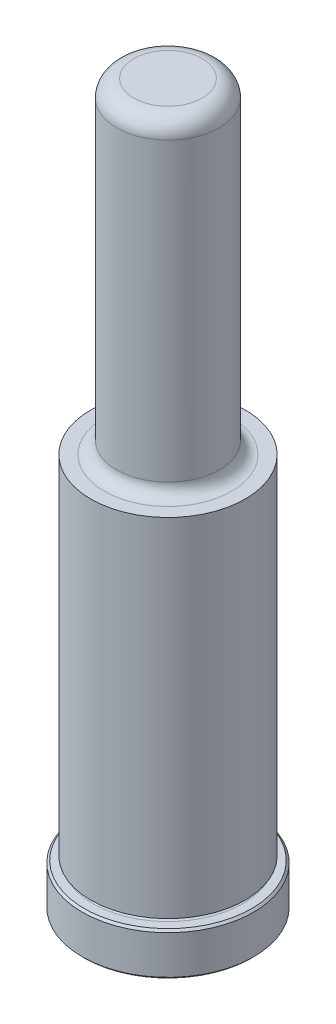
from build123d import *

# Parameters (mm, degrees)
CHAMFER1_SIZE = 0.381
FILLET7_R     = 3.175


with BuildPart() as part:
    # Sketch1 → Revolve1 (revolve)
    with BuildSketch(Plane(origin=(0, 0, 0), x_dir=(0, 0, -1), z_dir=(1, 0, 0)), mode=Mode.PRIVATE) as revolve1_sk:
        with BuildLine():
            Line((0, 0), (15.875, 0))
            Line((15.875, 0), (15.875, 7.9248))
            Line((15.875, 7.9248), (13.8938, 7.9248))
            ThreePointArc((13.8938, 7.9248), (13.5128, 8.3058), (13.8938, 8.6868))
            Line((13.8938, 8.6868), (14.3002, 8.6868))
            Line((14.3002, 8.6868), (14.3002, 73.025))
            Line((14.3002, 73.025), (11.7983, 73.025))
            ThreePointArc((11.7983, 73.025), (10.181853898, 73.694553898), (9.5123, 75.311))
            Line((9.5123, 75.311), (9.5123, 133.35))
            Line((9.5123, 133.35), (0, 133.35))
            Line((0, 133.35), (0, 0))
        make_face()
    revolve(revolve1_sk.sketch.rotate(Axis((0, 0, 0), (0, -1, 0)), 180), axis=Axis((0, 0, 0), (0, -1, 0)))

    # Chamfer1
    chamfer1_edges = [part.edges().sort_by_distance(p)[0] for p in [
        (0, 7.9248, -15.875),
        (0, 0, -15.875),
    ]]
    chamfer(chamfer1_edges, length=CHAMFER1_SIZE)

    # Fillet7
    fillet7_edges = [part.edges().sort_by_distance(p)[0] for p in [
        (0, 133.35, -9.5123),
    ]]
    fillet(fillet7_edges, radius=FILLET7_R)


solid = part.part
